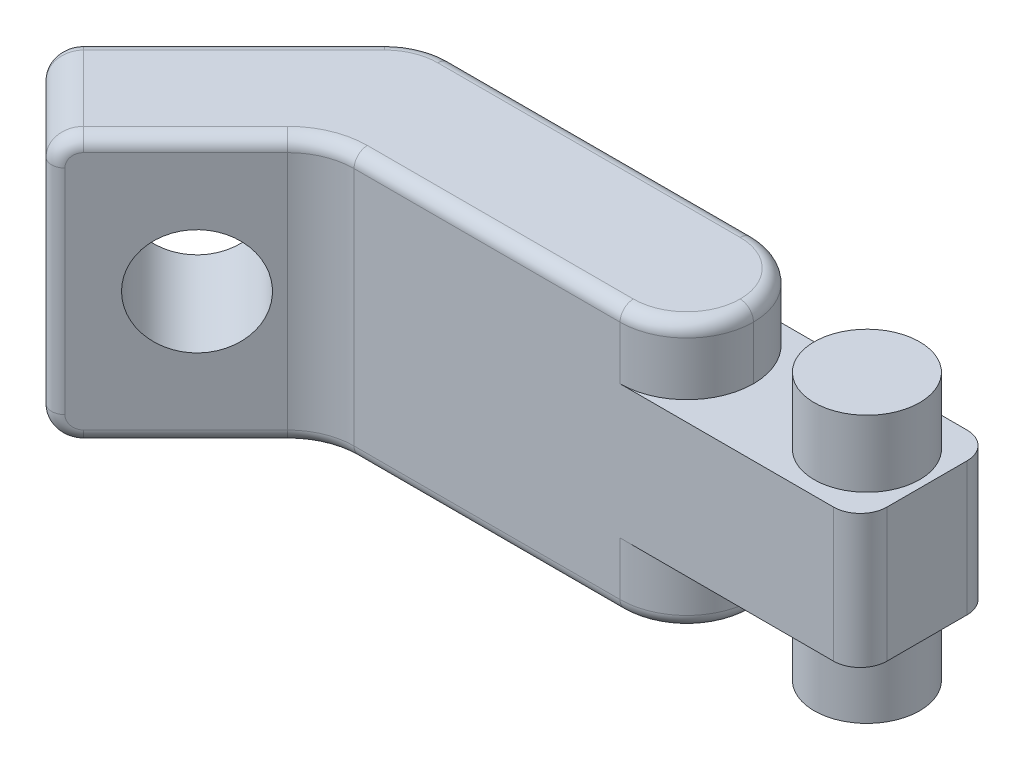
ISO-10303-21;
HEADER;
FILE_DESCRIPTION(('STEP AP214'),'2;1');
FILE_NAME('part.step','',(''),(''),'','','');
FILE_SCHEMA(('AUTOMOTIVE_DESIGN { 1 0 10303 214 1 1 1 1 }'));
ENDSEC;
DATA;
#1=APPLICATION_CONTEXT('core data for automotive mechanical design processes');
#2=APPLICATION_PROTOCOL_DEFINITION('international standard','automotive_design',2000,#1);
#3=PRODUCT_CONTEXT('',#1,'mechanical');
#4=PRODUCT('Part','Part','',(#3));
#5=PRODUCT_RELATED_PRODUCT_CATEGORY('part','',(#4));
#6=PRODUCT_DEFINITION_FORMATION('','',#4);
#7=PRODUCT_DEFINITION_CONTEXT('part definition',#1,'design');
#8=PRODUCT_DEFINITION('design','',#6,#7);
#9=PRODUCT_DEFINITION_SHAPE('','',#8);
#10=(LENGTH_UNIT() NAMED_UNIT(*) SI_UNIT(.MILLI.,.METRE.));
#11=(NAMED_UNIT(*) PLANE_ANGLE_UNIT() SI_UNIT($,.RADIAN.));
#12=(NAMED_UNIT(*) SI_UNIT($,.STERADIAN.) SOLID_ANGLE_UNIT());
#13=UNCERTAINTY_MEASURE_WITH_UNIT(LENGTH_MEASURE(1.E-05),#10,'distance_accuracy_value','');
#14=(GEOMETRIC_REPRESENTATION_CONTEXT(3) GLOBAL_UNCERTAINTY_ASSIGNED_CONTEXT((#13)) GLOBAL_UNIT_ASSIGNED_CONTEXT((#10,
#11,#12)) REPRESENTATION_CONTEXT('',''));
#15=CARTESIAN_POINT('',(0.,0.,0.));
#16=DIRECTION('',(0.,0.,1.));
#17=DIRECTION('',(1.,0.,0.));
#18=AXIS2_PLACEMENT_3D('',#15,#16,#17);
#19=CARTESIAN_POINT('',(505.060966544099,-188.971143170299,-16.0898233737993));
#20=DIRECTION('',(-1.,0.,0.));
#21=DIRECTION('',(0.,-1.,0.));
#22=AXIS2_PLACEMENT_3D('',#19,#20,#21);
#23=PLANE('',#22);
#24=DIRECTION('',(0.,0.,-1.));
#25=VECTOR('',#24,1.);
#26=CARTESIAN_POINT('',(505.060966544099,-38.9711431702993,-16.0898233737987));
#27=LINE('',#26,#25);
#28=CARTESIAN_POINT('',(505.060966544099,-38.9711431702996,63.9101766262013));
#29=VERTEX_POINT('',#28);
#30=CARTESIAN_POINT('',(505.060966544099,-38.9711431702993,3.91017662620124));
#31=VERTEX_POINT('',#30);
#32=EDGE_CURVE('E244',#29,#31,#27,.T.);
#33=ORIENTED_EDGE('',*,*,#32,.F.);
#34=DIRECTION('',(0.,1.,0.));
#35=VECTOR('',#34,1.);
#36=CARTESIAN_POINT('',(505.060966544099,-188.9711431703,63.9101766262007));
#37=LINE('',#36,#35);
#38=CARTESIAN_POINT('',(505.060966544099,-138.9711431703,63.9101766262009));
#39=VERTEX_POINT('',#38);
#40=EDGE_CURVE('E288',#29,#39,#37,.F.);
#41=ORIENTED_EDGE('',*,*,#40,.T.);
#42=DIRECTION('',(0.,0.,1.));
#43=VECTOR('',#42,1.);
#44=CARTESIAN_POINT('',(505.060966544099,-138.971143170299,-16.0898233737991));
#45=LINE('',#44,#43);
#46=CARTESIAN_POINT('',(505.060966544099,-138.971143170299,3.91017662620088));
#47=VERTEX_POINT('',#46);
#48=EDGE_CURVE('E458',#47,#39,#45,.T.);
#49=ORIENTED_EDGE('',*,*,#48,.F.);
#50=DIRECTION('',(0.,1.,0.));
#51=VECTOR('',#50,1.);
#52=CARTESIAN_POINT('',(505.060966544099,-188.971143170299,3.91017662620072));
#53=LINE('',#52,#51);
#54=EDGE_CURVE('E263',#47,#31,#53,.T.);
#55=ORIENTED_EDGE('',*,*,#54,.T.);
#56=EDGE_LOOP('',(#33,#41,#49,#55));
#57=FACE_BOUND('',#56,.T.);
#58=ADVANCED_FACE('F42',(#57),#23,.F.);
#59=CARTESIAN_POINT('',(77.7817459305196,-188.971143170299,-16.0898233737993));
#60=DIRECTION('',(0.,0.,1.));
#61=DIRECTION('',(0.,-1.,0.));
#62=AXIS2_PLACEMENT_3D('',#59,#60,#61);
#63=PLANE('',#62);
#64=DIRECTION('',(0.,1.,0.));
#65=VECTOR('',#64,1.);
#66=CARTESIAN_POINT('',(98.4924240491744,-188.971143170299,-16.0898233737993));
#67=LINE('',#66,#65);
#68=CARTESIAN_POINT('',(98.4924240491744,-178.971143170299,-16.0898233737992));
#69=VERTEX_POINT('',#68);
#70=CARTESIAN_POINT('',(98.4924240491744,1.02885682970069,-16.0898233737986));
#71=VERTEX_POINT('',#70);
#72=EDGE_CURVE('E486',#69,#71,#67,.T.);
#73=ORIENTED_EDGE('',*,*,#72,.T.);
#74=DIRECTION('',(1.,0.,0.));
#75=VECTOR('',#74,1.);
#76=CARTESIAN_POINT('',(77.7817459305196,1.02885682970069,-16.0898233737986));
#77=LINE('',#76,#75);
#78=CARTESIAN_POINT('',(325.060966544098,1.02885682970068,-16.0898233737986));
#79=VERTEX_POINT('',#78);
#80=EDGE_CURVE('E338',#71,#79,#77,.T.);
#81=ORIENTED_EDGE('',*,*,#80,.T.);
#82=DIRECTION('',(0.,-1.,0.));
#83=VECTOR('',#82,1.);
#84=CARTESIAN_POINT('',(325.060966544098,-38.9711431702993,-16.0898233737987));
#85=LINE('',#84,#83);
#86=CARTESIAN_POINT('',(325.060966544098,-38.9711431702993,-16.0898233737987));
#87=VERTEX_POINT('',#86);
#88=EDGE_CURVE('E258',#79,#87,#85,.T.);
#89=ORIENTED_EDGE('',*,*,#88,.T.);
#90=DIRECTION('',(-1.,0.,0.));
#91=VECTOR('',#90,1.);
#92=CARTESIAN_POINT('',(77.7817459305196,-38.9711431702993,-16.0898233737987));
#93=LINE('',#92,#91);
#94=CARTESIAN_POINT('',(485.060966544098,-38.9711431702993,-16.0898233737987));
#95=VERTEX_POINT('',#94);
#96=EDGE_CURVE('E241',#95,#87,#93,.T.);
#97=ORIENTED_EDGE('',*,*,#96,.F.);
#98=DIRECTION('',(0.,1.,0.));
#99=VECTOR('',#98,1.);
#100=CARTESIAN_POINT('',(485.060966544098,-188.971143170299,-16.0898233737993));
#101=LINE('',#100,#99);
#102=CARTESIAN_POINT('',(485.060966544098,-138.971143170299,-16.0898233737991));
#103=VERTEX_POINT('',#102);
#104=EDGE_CURVE('E255',#95,#103,#101,.F.);
#105=ORIENTED_EDGE('',*,*,#104,.T.);
#106=DIRECTION('',(1.,0.,0.));
#107=VECTOR('',#106,1.);
#108=CARTESIAN_POINT('',(77.7817459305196,-138.971143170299,-16.0898233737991));
#109=LINE('',#108,#107);
#110=CARTESIAN_POINT('',(325.060966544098,-138.971143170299,-16.0898233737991));
#111=VERTEX_POINT('',#110);
#112=EDGE_CURVE('E461',#111,#103,#109,.T.);
#113=ORIENTED_EDGE('',*,*,#112,.F.);
#114=DIRECTION('',(0.,-1.,0.));
#115=VECTOR('',#114,1.);
#116=CARTESIAN_POINT('',(325.060966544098,-188.971143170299,-16.0898233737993));
#117=LINE('',#116,#115);
#118=CARTESIAN_POINT('',(325.060966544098,-178.971143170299,-16.0898233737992));
#119=VERTEX_POINT('',#118);
#120=EDGE_CURVE('E502',#111,#119,#117,.T.);
#121=ORIENTED_EDGE('',*,*,#120,.T.);
#122=DIRECTION('',(1.,0.,0.));
#123=VECTOR('',#122,1.);
#124=CARTESIAN_POINT('',(98.4924240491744,-178.971143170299,-16.0898233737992));
#125=LINE('',#124,#123);
#126=EDGE_CURVE('E336',#119,#69,#125,.F.);
#127=ORIENTED_EDGE('',*,*,#126,.T.);
#128=EDGE_LOOP('',(#73,#81,#89,#97,#105,#113,#121,#127));
#129=FACE_BOUND('',#128,.T.);
#130=ADVANCED_FACE('F254',(#129),#63,.F.);
#131=CARTESIAN_POINT('',(505.060966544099,-188.9711431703,83.9101766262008));
#132=DIRECTION('',(0.,0.,-1.));
#133=DIRECTION('',(1.,0.,0.));
#134=AXIS2_PLACEMENT_3D('',#131,#132,#133);
#135=PLANE('',#134);
#136=DIRECTION('',(0.,-1.,0.));
#137=VECTOR('',#136,1.);
#138=CARTESIAN_POINT('',(325.060966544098,11.0288568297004,83.9101766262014));
#139=LINE('',#138,#137);
#140=CARTESIAN_POINT('',(325.060966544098,-38.9711431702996,83.9101766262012));
#141=VERTEX_POINT('',#140);
#142=CARTESIAN_POINT('',(325.060966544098,1.02885682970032,83.9101766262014));
#143=VERTEX_POINT('',#142);
#144=EDGE_CURVE('E274',#141,#143,#139,.F.);
#145=ORIENTED_EDGE('',*,*,#144,.T.);
#146=DIRECTION('',(-1.,0.,0.));
#147=VECTOR('',#146,1.);
#148=CARTESIAN_POINT('',(505.060966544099,1.02885682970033,83.9101766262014));
#149=LINE('',#148,#147);
#150=CARTESIAN_POINT('',(125.771644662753,1.02885682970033,83.9101766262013));
#151=VERTEX_POINT('',#150);
#152=EDGE_CURVE('E346',#143,#151,#149,.T.);
#153=ORIENTED_EDGE('',*,*,#152,.T.);
#154=DIRECTION('',(0.,1.,0.));
#155=VECTOR('',#154,1.);
#156=CARTESIAN_POINT('',(125.771644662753,-188.9711431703,83.9101766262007));
#157=LINE('',#156,#155);
#158=CARTESIAN_POINT('',(125.771644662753,-178.9711431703,83.9101766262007));
#159=VERTEX_POINT('',#158);
#160=EDGE_CURVE('E483',#151,#159,#157,.F.);
#161=ORIENTED_EDGE('',*,*,#160,.T.);
#162=DIRECTION('',(-1.,0.,0.));
#163=VECTOR('',#162,1.);
#164=CARTESIAN_POINT('',(325.060966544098,-178.9711431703,83.9101766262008));
#165=LINE('',#164,#163);
#166=CARTESIAN_POINT('',(325.060966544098,-178.9711431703,83.9101766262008));
#167=VERTEX_POINT('',#166);
#168=EDGE_CURVE('E344',#159,#167,#165,.F.);
#169=ORIENTED_EDGE('',*,*,#168,.T.);
#170=DIRECTION('',(0.,-1.,0.));
#171=VECTOR('',#170,1.);
#172=CARTESIAN_POINT('',(325.060966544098,-188.9711431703,83.9101766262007));
#173=LINE('',#172,#171);
#174=CARTESIAN_POINT('',(325.060966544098,-138.9711431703,83.9101766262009));
#175=VERTEX_POINT('',#174);
#176=EDGE_CURVE('E494',#167,#175,#173,.F.);
#177=ORIENTED_EDGE('',*,*,#176,.T.);
#178=DIRECTION('',(-1.,0.,0.));
#179=VECTOR('',#178,1.);
#180=CARTESIAN_POINT('',(505.060966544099,-138.9711431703,83.9101766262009));
#181=LINE('',#180,#179);
#182=CARTESIAN_POINT('',(485.060966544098,-138.9711431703,83.9101766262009));
#183=VERTEX_POINT('',#182);
#184=EDGE_CURVE('E491',#183,#175,#181,.T.);
#185=ORIENTED_EDGE('',*,*,#184,.F.);
#186=DIRECTION('',(0.,1.,0.));
#187=VECTOR('',#186,1.);
#188=CARTESIAN_POINT('',(485.060966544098,-188.9711431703,83.9101766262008));
#189=LINE('',#188,#187);
#190=CARTESIAN_POINT('',(485.060966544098,-38.9711431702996,83.9101766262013));
#191=VERTEX_POINT('',#190);
#192=EDGE_CURVE('E283',#183,#191,#189,.T.);
#193=ORIENTED_EDGE('',*,*,#192,.T.);
#194=DIRECTION('',(1.,0.,0.));
#195=VECTOR('',#194,1.);
#196=CARTESIAN_POINT('',(505.060966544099,-38.9711431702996,83.9101766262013));
#197=LINE('',#196,#195);
#198=EDGE_CURVE('E452',#141,#191,#197,.T.);
#199=ORIENTED_EDGE('',*,*,#198,.F.);
#200=EDGE_LOOP('',(#145,#153,#161,#169,#177,#185,#193,#199));
#201=FACE_BOUND('',#200,.T.);
#202=ADVANCED_FACE('F604',(#201),#135,.F.);
#203=CARTESIAN_POINT('',(485.060966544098,-188.971143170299,3.91017662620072));
#204=DIRECTION('',(0.,1.,0.));
#205=DIRECTION('',(-1.,0.,0.));
#206=AXIS2_PLACEMENT_3D('',#203,#204,#205);
#207=CYLINDRICAL_SURFACE('',#206,20.);
#208=ORIENTED_EDGE('',*,*,#104,.F.);
#209=CARTESIAN_POINT('',(485.060966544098,-38.9711431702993,3.91017662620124));
#210=DIRECTION('',(0.,1.,0.));
#211=DIRECTION('',(-1.,0.,0.));
#212=AXIS2_PLACEMENT_3D('',#209,#210,#211);
#213=CIRCLE('',#212,20.);
#214=EDGE_CURVE('E236',#95,#31,#213,.F.);
#215=ORIENTED_EDGE('',*,*,#214,.T.);
#216=ORIENTED_EDGE('',*,*,#54,.F.);
#217=CARTESIAN_POINT('',(485.060966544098,-138.971143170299,3.91017662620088));
#218=DIRECTION('',(0.,-1.,0.));
#219=DIRECTION('',(1.,0.,0.));
#220=AXIS2_PLACEMENT_3D('',#217,#218,#219);
#221=CIRCLE('',#220,20.);
#222=EDGE_CURVE('E250',#103,#47,#221,.T.);
#223=ORIENTED_EDGE('',*,*,#222,.F.);
#224=EDGE_LOOP('',(#208,#215,#216,#223));
#225=FACE_BOUND('',#224,.T.);
#226=ADVANCED_FACE('F262',(#225),#207,.T.);
#227=CARTESIAN_POINT('',(105.060966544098,-188.9711431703,83.9101766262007));
#228=DIRECTION('',(-0.707106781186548,0.,-0.707106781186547));
#229=DIRECTION('',(0.707106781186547,0.,-0.707106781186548));
#230=AXIS2_PLACEMENT_3D('',#227,#228,#229);
#231=PLANE('',#230);
#232=CARTESIAN_POINT('',(56.5685424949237,-88.9711431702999,132.402600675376));
#233=DIRECTION('',(0.707106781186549,0.,0.707106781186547));
#234=DIRECTION('',(-0.707106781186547,0.,0.707106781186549));
#235=AXIS2_PLACEMENT_3D('',#232,#233,#234);
#236=CIRCLE('',#235,40.);
#237=CARTESIAN_POINT('',(28.2842712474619,-88.9711431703,160.686871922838));
#238=VERTEX_POINT('',#237);
#239=EDGE_CURVE('E463',#238,#238,#236,.T.);
#240=ORIENTED_EDGE('',*,*,#239,.F.);
#241=EDGE_LOOP('',(#240));
#242=FACE_BOUND('',#241,.T.);
#243=DIRECTION('',(0.,1.,0.));
#244=VECTOR('',#243,1.);
#245=CARTESIAN_POINT('',(90.4163056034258,11.0288568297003,98.5548375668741));
#246=LINE('',#245,#244);
#247=CARTESIAN_POINT('',(90.4163056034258,-178.9711431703,98.5548375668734));
#248=VERTEX_POINT('',#247);
#249=CARTESIAN_POINT('',(90.4163056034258,1.02885682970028,98.554837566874));
#250=VERTEX_POINT('',#249);
#251=EDGE_CURVE('E480',#248,#250,#246,.T.);
#252=ORIENTED_EDGE('',*,*,#251,.T.);
#253=DIRECTION('',(-0.707106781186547,0.,0.707106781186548));
#254=VECTOR('',#253,1.);
#255=CARTESIAN_POINT('',(105.060966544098,1.02885682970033,83.9101766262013));
#256=LINE('',#255,#254);
#257=CARTESIAN_POINT('',(14.1421356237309,1.02885682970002,174.829007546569));
#258=VERTEX_POINT('',#257);
#259=EDGE_CURVE('E360',#250,#258,#256,.T.);
#260=ORIENTED_EDGE('',*,*,#259,.T.);
#261=CARTESIAN_POINT('',(14.1421356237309,-8.97114317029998,174.829007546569));
#262=DIRECTION('',(-0.707106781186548,0.,-0.707106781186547));
#263=DIRECTION('',(-0.707106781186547,0.,0.707106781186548));
#264=AXIS2_PLACEMENT_3D('',#261,#262,#263);
#265=CIRCLE('',#264,10.);
#266=CARTESIAN_POINT('',(7.07106781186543,-8.9711431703,181.900075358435));
#267=VERTEX_POINT('',#266);
#268=EDGE_CURVE('E358',#258,#267,#265,.F.);
#269=ORIENTED_EDGE('',*,*,#268,.T.);
#270=DIRECTION('',(0.,1.,0.));
#271=VECTOR('',#270,1.);
#272=CARTESIAN_POINT('',(7.07106781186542,-188.9711431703,181.900075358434));
#273=LINE('',#272,#271);
#274=CARTESIAN_POINT('',(7.07106781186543,-168.9711431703,181.900075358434));
#275=VERTEX_POINT('',#274);
#276=EDGE_CURVE('E356',#267,#275,#273,.F.);
#277=ORIENTED_EDGE('',*,*,#276,.T.);
#278=CARTESIAN_POINT('',(14.1421356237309,-168.9711431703,174.829007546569));
#279=DIRECTION('',(-0.707106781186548,0.,-0.707106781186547));
#280=DIRECTION('',(-0.707106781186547,0.,0.707106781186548));
#281=AXIS2_PLACEMENT_3D('',#278,#279,#280);
#282=CIRCLE('',#281,10.);
#283=CARTESIAN_POINT('',(14.1421356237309,-178.9711431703,174.829007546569));
#284=VERTEX_POINT('',#283);
#285=EDGE_CURVE('E354',#275,#284,#282,.F.);
#286=ORIENTED_EDGE('',*,*,#285,.T.);
#287=DIRECTION('',(-0.707106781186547,0.,0.707106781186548));
#288=VECTOR('',#287,1.);
#289=CARTESIAN_POINT('',(90.4163056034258,-178.9711431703,98.5548375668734));
#290=LINE('',#289,#288);
#291=EDGE_CURVE('E352',#284,#248,#290,.F.);
#292=ORIENTED_EDGE('',*,*,#291,.T.);
#293=EDGE_LOOP('',(#252,#260,#269,#277,#286,#292));
#294=FACE_BOUND('',#293,.T.);
#295=ADVANCED_FACE('F564',(#242,#294),#231,.F.);
#296=CARTESIAN_POINT('',(0.,-188.9711431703,188.971143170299));
#297=DIRECTION('',(0.707106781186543,0.,-0.707106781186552));
#298=DIRECTION('',(0.707106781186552,0.,0.707106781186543));
#299=AXIS2_PLACEMENT_3D('',#296,#297,#298);
#300=PLANE('',#299);
#301=DIRECTION('',(-0.707106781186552,0.,-0.707106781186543));
#302=VECTOR('',#301,1.);
#303=CARTESIAN_POINT('',(0.,-8.97114317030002,188.9711431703));
#304=LINE('',#303,#302);
#305=CARTESIAN_POINT('',(-7.07106781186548,-8.9711431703,181.900075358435));
#306=VERTEX_POINT('',#305);
#307=CARTESIAN_POINT('',(-56.5685424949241,-8.97114317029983,132.402600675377));
#308=VERTEX_POINT('',#307);
#309=EDGE_CURVE('E474',#306,#308,#304,.T.);
#310=ORIENTED_EDGE('',*,*,#309,.T.);
#311=DIRECTION('',(0.,1.,0.));
#312=VECTOR('',#311,1.);
#313=CARTESIAN_POINT('',(-56.5685424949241,-188.9711431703,132.402600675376));
#314=LINE('',#313,#312);
#315=CARTESIAN_POINT('',(-56.5685424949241,-168.9711431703,132.402600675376));
#316=VERTEX_POINT('',#315);
#317=EDGE_CURVE('E310',#308,#316,#314,.F.);
#318=ORIENTED_EDGE('',*,*,#317,.T.);
#319=DIRECTION('',(-0.707106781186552,0.,-0.707106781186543));
#320=VECTOR('',#319,1.);
#321=CARTESIAN_POINT('',(0.,-168.9711431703,188.971143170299));
#322=LINE('',#321,#320);
#323=CARTESIAN_POINT('',(-7.07106781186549,-168.9711431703,181.900075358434));
#324=VERTEX_POINT('',#323);
#325=EDGE_CURVE('E471',#316,#324,#322,.F.);
#326=ORIENTED_EDGE('',*,*,#325,.T.);
#327=DIRECTION('',(0.,1.,0.));
#328=VECTOR('',#327,1.);
#329=CARTESIAN_POINT('',(-7.07106781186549,-188.9711431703,181.900075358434));
#330=LINE('',#329,#328);
#331=EDGE_CURVE('E308',#324,#306,#330,.T.);
#332=ORIENTED_EDGE('',*,*,#331,.T.);
#333=EDGE_LOOP('',(#310,#318,#326,#332));
#334=FACE_BOUND('',#333,.T.);
#335=ADVANCED_FACE('F553',(#334),#300,.F.);
#336=CARTESIAN_POINT('',(-63.6396103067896,-188.9711431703,125.331532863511));
#337=DIRECTION('',(0.707106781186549,0.,0.707106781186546));
#338=DIRECTION('',(-0.707106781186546,0.,0.707106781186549));
#339=AXIS2_PLACEMENT_3D('',#336,#337,#338);
#340=PLANE('',#339);
#341=CARTESIAN_POINT('',(-7.07106781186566,-88.9711431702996,68.7629903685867));
#342=DIRECTION('',(0.707106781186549,0.,0.707106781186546));
#343=DIRECTION('',(-0.707106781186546,0.,0.707106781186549));
#344=AXIS2_PLACEMENT_3D('',#341,#342,#343);
#345=CIRCLE('',#344,40.);
#346=CARTESIAN_POINT('',(-35.3553390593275,-88.9711431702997,97.0472616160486));
#347=VERTEX_POINT('',#346);
#348=EDGE_CURVE('E466',#347,#347,#345,.T.);
#349=ORIENTED_EDGE('',*,*,#348,.T.);
#350=EDGE_LOOP('',(#349));
#351=FACE_BOUND('',#350,.T.);
#352=CARTESIAN_POINT('',(-49.4974746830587,-8.97114317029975,111.18939723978));
#353=DIRECTION('',(0.707106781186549,0.,0.707106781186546));
#354=DIRECTION('',(0.707106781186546,0.,-0.707106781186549));
#355=AXIS2_PLACEMENT_3D('',#352,#353,#354);
#356=CIRCLE('',#355,10.);
#357=CARTESIAN_POINT('',(-56.5685424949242,-8.97114317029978,118.260465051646));
#358=VERTEX_POINT('',#357);
#359=CARTESIAN_POINT('',(-49.4974746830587,1.02885682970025,111.18939723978));
#360=VERTEX_POINT('',#359);
#361=EDGE_CURVE('E299',#358,#360,#356,.F.);
#362=ORIENTED_EDGE('',*,*,#361,.T.);
#363=DIRECTION('',(0.707106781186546,0.,-0.707106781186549));
#364=VECTOR('',#363,1.);
#365=CARTESIAN_POINT('',(-63.6396103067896,1.02885682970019,125.331532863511));
#366=LINE('',#365,#364);
#367=CARTESIAN_POINT('',(63.1370849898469,1.02885682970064,-1.4451624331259));
#368=VERTEX_POINT('',#367);
#369=EDGE_CURVE('E301',#360,#368,#366,.T.);
#370=ORIENTED_EDGE('',*,*,#369,.T.);
#371=DIRECTION('',(0.,1.,0.));
#372=VECTOR('',#371,1.);
#373=CARTESIAN_POINT('',(63.1370849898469,-188.971143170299,-1.44516243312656));
#374=LINE('',#373,#372);
#375=CARTESIAN_POINT('',(63.1370849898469,-178.971143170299,-1.44516243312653));
#376=VERTEX_POINT('',#375);
#377=EDGE_CURVE('E488',#368,#376,#374,.F.);
#378=ORIENTED_EDGE('',*,*,#377,.T.);
#379=DIRECTION('',(0.707106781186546,0.,-0.707106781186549));
#380=VECTOR('',#379,1.);
#381=CARTESIAN_POINT('',(-49.4974746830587,-178.9711431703,111.18939723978));
#382=LINE('',#381,#380);
#383=CARTESIAN_POINT('',(-49.4974746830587,-178.9711431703,111.18939723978));
#384=VERTEX_POINT('',#383);
#385=EDGE_CURVE('E292',#376,#384,#382,.F.);
#386=ORIENTED_EDGE('',*,*,#385,.T.);
#387=CARTESIAN_POINT('',(-49.4974746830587,-168.9711431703,111.18939723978));
#388=DIRECTION('',(0.707106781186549,0.,0.707106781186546));
#389=DIRECTION('',(0.707106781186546,0.,-0.707106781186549));
#390=AXIS2_PLACEMENT_3D('',#387,#388,#389);
#391=CIRCLE('',#390,10.);
#392=CARTESIAN_POINT('',(-56.5685424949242,-168.9711431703,118.260465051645));
#393=VERTEX_POINT('',#392);
#394=EDGE_CURVE('E294',#384,#393,#391,.F.);
#395=ORIENTED_EDGE('',*,*,#394,.T.);
#396=DIRECTION('',(0.,1.,0.));
#397=VECTOR('',#396,1.);
#398=CARTESIAN_POINT('',(-56.5685424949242,-188.9711431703,118.260465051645));
#399=LINE('',#398,#397);
#400=EDGE_CURVE('E297',#393,#358,#399,.T.);
#401=ORIENTED_EDGE('',*,*,#400,.T.);
#402=EDGE_LOOP('',(#362,#370,#378,#386,#395,#401));
#403=FACE_BOUND('',#402,.T.);
#404=ADVANCED_FACE('F533',(#351,#403),#340,.F.);
#405=CARTESIAN_POINT('',(0.,-188.9711431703,188.971143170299));
#406=DIRECTION('',(0.,-1.,0.));
#407=DIRECTION('',(1.,0.,0.));
#408=AXIS2_PLACEMENT_3D('',#405,#406,#407);
#409=PLANE('',#408);
#410=DIRECTION('',(-0.707106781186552,0.,-0.707106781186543));
#411=VECTOR('',#410,1.);
#412=CARTESIAN_POINT('',(-49.4974746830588,-188.9711431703,111.189397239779));
#413=LINE('',#412,#411);
#414=CARTESIAN_POINT('',(7.07106781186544,-188.9711431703,167.757939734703));
#415=VERTEX_POINT('',#414);
#416=CARTESIAN_POINT('',(-42.4264068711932,-188.9711431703,118.260465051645));
#417=VERTEX_POINT('',#416);
#418=EDGE_CURVE('E469',#415,#417,#413,.T.);
#419=ORIENTED_EDGE('',*,*,#418,.T.);
#420=DIRECTION('',(0.707106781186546,0.,-0.707106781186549));
#421=VECTOR('',#420,1.);
#422=CARTESIAN_POINT('',(70.2081528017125,-188.971143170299,5.62590537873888));
#423=LINE('',#422,#421);
#424=CARTESIAN_POINT('',(70.2081528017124,-188.971143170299,5.62590537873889));
#425=VERTEX_POINT('',#424);
#426=EDGE_CURVE('E66',#417,#425,#423,.T.);
#427=ORIENTED_EDGE('',*,*,#426,.T.);
#428=CARTESIAN_POINT('',(98.4924240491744,-188.9711431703,33.9101766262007));
#429=DIRECTION('',(0.,-1.,0.));
#430=DIRECTION('',(0.,0.,-1.));
#431=AXIS2_PLACEMENT_3D('',#428,#429,#430);
#432=CIRCLE('',#431,40.);
#433=CARTESIAN_POINT('',(98.4924240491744,-188.971143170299,-6.08982337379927));
#434=VERTEX_POINT('',#433);
#435=EDGE_CURVE('E374',#425,#434,#432,.T.);
#436=ORIENTED_EDGE('',*,*,#435,.T.);
#437=DIRECTION('',(1.,0.,0.));
#438=VECTOR('',#437,1.);
#439=CARTESIAN_POINT('',(325.060966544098,-188.971143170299,-6.08982337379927));
#440=LINE('',#439,#438);
#441=CARTESIAN_POINT('',(325.060966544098,-188.971143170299,-6.08982337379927));
#442=VERTEX_POINT('',#441);
#443=EDGE_CURVE('E362',#434,#442,#440,.T.);
#444=ORIENTED_EDGE('',*,*,#443,.T.);
#445=CARTESIAN_POINT('',(325.060966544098,-188.9711431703,33.9101766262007));
#446=DIRECTION('',(0.,-1.,0.));
#447=DIRECTION('',(0.,0.,-1.));
#448=AXIS2_PLACEMENT_3D('',#445,#446,#447);
#449=CIRCLE('',#448,40.);
#450=CARTESIAN_POINT('',(365.060966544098,-188.9711431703,33.9101766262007));
#451=VERTEX_POINT('',#450);
#452=EDGE_CURVE('E364',#442,#451,#449,.T.);
#453=ORIENTED_EDGE('',*,*,#452,.T.);
#454=CARTESIAN_POINT('',(325.060966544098,-188.9711431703,33.9101766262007));
#455=DIRECTION('',(0.,-1.,0.));
#456=DIRECTION('',(0.,0.,-1.));
#457=AXIS2_PLACEMENT_3D('',#454,#455,#456);
#458=CIRCLE('',#457,40.);
#459=CARTESIAN_POINT('',(325.060966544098,-188.9711431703,73.9101766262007));
#460=VERTEX_POINT('',#459);
#461=EDGE_CURVE('E366',#451,#460,#458,.T.);
#462=ORIENTED_EDGE('',*,*,#461,.T.);
#463=DIRECTION('',(-1.,0.,0.));
#464=VECTOR('',#463,1.);
#465=CARTESIAN_POINT('',(125.771644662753,-188.9711431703,73.9101766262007));
#466=LINE('',#465,#464);
#467=CARTESIAN_POINT('',(125.771644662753,-188.9711431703,73.9101766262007));
#468=VERTEX_POINT('',#467);
#469=EDGE_CURVE('E368',#460,#468,#466,.T.);
#470=ORIENTED_EDGE('',*,*,#469,.T.);
#471=CARTESIAN_POINT('',(125.771644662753,-188.9711431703,133.910176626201));
#472=DIRECTION('',(0.,-1.,0.));
#473=DIRECTION('',(0.,0.,-1.));
#474=AXIS2_PLACEMENT_3D('',#471,#472,#473);
#475=CIRCLE('',#474,60.);
#476=CARTESIAN_POINT('',(83.3452377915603,-188.9711431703,91.4837697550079));
#477=VERTEX_POINT('',#476);
#478=EDGE_CURVE('E370',#468,#477,#475,.F.);
#479=ORIENTED_EDGE('',*,*,#478,.T.);
#480=DIRECTION('',(-0.707106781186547,0.,0.707106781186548));
#481=VECTOR('',#480,1.);
#482=CARTESIAN_POINT('',(7.07106781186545,-188.9711431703,167.757939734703));
#483=LINE('',#482,#481);
#484=EDGE_CURVE('E372',#477,#415,#483,.T.);
#485=ORIENTED_EDGE('',*,*,#484,.T.);
#486=EDGE_LOOP('',(#419,#427,#436,#444,#453,#462,#470,#479,#485));
#487=FACE_BOUND('',#486,.T.);
#488=ADVANCED_FACE('F635',(#487),#409,.T.);
#489=CARTESIAN_POINT('',(0.,11.0288568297,188.9711431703));
#490=DIRECTION('',(0.,-1.,0.));
#491=DIRECTION('',(1.,0.,0.));
#492=AXIS2_PLACEMENT_3D('',#489,#490,#491);
#493=PLANE('',#492);
#494=CARTESIAN_POINT('',(98.4924240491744,11.0288568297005,33.9101766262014));
#495=DIRECTION('',(0.,-1.,0.));
#496=DIRECTION('',(0.,0.,-1.));
#497=AXIS2_PLACEMENT_3D('',#494,#495,#496);
#498=CIRCLE('',#497,40.);
#499=CARTESIAN_POINT('',(98.4924240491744,11.0288568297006,-6.08982337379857));
#500=VERTEX_POINT('',#499);
#501=CARTESIAN_POINT('',(70.2081528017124,11.0288568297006,5.62590537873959));
#502=VERTEX_POINT('',#501);
#503=EDGE_CURVE('E328',#500,#502,#498,.F.);
#504=ORIENTED_EDGE('',*,*,#503,.T.);
#505=DIRECTION('',(0.707106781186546,0.,-0.707106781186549));
#506=VECTOR('',#505,1.);
#507=CARTESIAN_POINT('',(-56.5685424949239,11.0288568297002,132.402600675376));
#508=LINE('',#507,#506);
#509=CARTESIAN_POINT('',(-42.4264068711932,11.0288568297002,118.260465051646));
#510=VERTEX_POINT('',#509);
#511=EDGE_CURVE('E330',#502,#510,#508,.F.);
#512=ORIENTED_EDGE('',*,*,#511,.T.);
#513=DIRECTION('',(-0.707106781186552,0.,-0.707106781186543));
#514=VECTOR('',#513,1.);
#515=CARTESIAN_POINT('',(14.1421356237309,11.0288568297,174.829007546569));
#516=LINE('',#515,#514);
#517=CARTESIAN_POINT('',(7.07106781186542,11.0288568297,167.757939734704));
#518=VERTEX_POINT('',#517);
#519=EDGE_CURVE('E477',#510,#518,#516,.F.);
#520=ORIENTED_EDGE('',*,*,#519,.T.);
#521=DIRECTION('',(-0.707106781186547,0.,0.707106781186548));
#522=VECTOR('',#521,1.);
#523=CARTESIAN_POINT('',(-7.07106781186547,11.0288568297,181.900075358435));
#524=LINE('',#523,#522);
#525=CARTESIAN_POINT('',(83.3452377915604,11.0288568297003,91.4837697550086));
#526=VERTEX_POINT('',#525);
#527=EDGE_CURVE('E316',#518,#526,#524,.F.);
#528=ORIENTED_EDGE('',*,*,#527,.T.);
#529=CARTESIAN_POINT('',(125.771644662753,11.0288568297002,133.910176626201));
#530=DIRECTION('',(0.,-1.,0.));
#531=DIRECTION('',(0.,0.,-1.));
#532=AXIS2_PLACEMENT_3D('',#529,#530,#531);
#533=CIRCLE('',#532,60.);
#534=CARTESIAN_POINT('',(125.771644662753,11.0288568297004,73.9101766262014));
#535=VERTEX_POINT('',#534);
#536=EDGE_CURVE('E318',#526,#535,#533,.T.);
#537=ORIENTED_EDGE('',*,*,#536,.T.);
#538=DIRECTION('',(-1.,0.,0.));
#539=VECTOR('',#538,1.);
#540=CARTESIAN_POINT('',(0.,11.0288568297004,73.9101766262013));
#541=LINE('',#540,#539);
#542=CARTESIAN_POINT('',(325.060966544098,11.0288568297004,73.9101766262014));
#543=VERTEX_POINT('',#542);
#544=EDGE_CURVE('E320',#535,#543,#541,.F.);
#545=ORIENTED_EDGE('',*,*,#544,.T.);
#546=CARTESIAN_POINT('',(325.060966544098,11.0288568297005,33.9101766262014));
#547=DIRECTION('',(0.,-1.,0.));
#548=DIRECTION('',(0.,0.,-1.));
#549=AXIS2_PLACEMENT_3D('',#546,#547,#548);
#550=CIRCLE('',#549,40.);
#551=CARTESIAN_POINT('',(365.060966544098,11.0288568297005,33.9101766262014));
#552=VERTEX_POINT('',#551);
#553=EDGE_CURVE('E322',#543,#552,#550,.F.);
#554=ORIENTED_EDGE('',*,*,#553,.T.);
#555=CARTESIAN_POINT('',(325.060966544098,11.0288568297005,33.9101766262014));
#556=DIRECTION('',(0.,-1.,0.));
#557=DIRECTION('',(0.,0.,-1.));
#558=AXIS2_PLACEMENT_3D('',#555,#556,#557);
#559=CIRCLE('',#558,40.);
#560=CARTESIAN_POINT('',(325.060966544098,11.0288568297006,-6.08982337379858));
#561=VERTEX_POINT('',#560);
#562=EDGE_CURVE('E324',#552,#561,#559,.F.);
#563=ORIENTED_EDGE('',*,*,#562,.T.);
#564=DIRECTION('',(1.,0.,0.));
#565=VECTOR('',#564,1.);
#566=CARTESIAN_POINT('',(0.,11.0288568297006,-6.08982337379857));
#567=LINE('',#566,#565);
#568=EDGE_CURVE('E326',#561,#500,#567,.F.);
#569=ORIENTED_EDGE('',*,*,#568,.T.);
#570=EDGE_LOOP('',(#504,#512,#520,#528,#537,#545,#554,#563,#569));
#571=FACE_BOUND('',#570,.T.);
#572=ADVANCED_FACE('F569',(#571),#493,.F.);
#573=CARTESIAN_POINT('',(-77.7817459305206,-88.9711431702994,-1.94768775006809));
#574=DIRECTION('',(0.707106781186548,0.,0.707106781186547));
#575=DIRECTION('',(-0.707106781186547,0.,0.707106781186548));
#576=AXIS2_PLACEMENT_3D('',#573,#574,#575);
#577=CYLINDRICAL_SURFACE('',#576,40.);
#578=ORIENTED_EDGE('',*,*,#239,.T.);
#579=EDGE_LOOP('',(#578));
#580=FACE_BOUND('',#579,.T.);
#581=ORIENTED_EDGE('',*,*,#348,.F.);
#582=EDGE_LOOP('',(#581));
#583=FACE_BOUND('',#582,.T.);
#584=ADVANCED_FACE('F645',(#580,#583),#577,.F.);
#585=CARTESIAN_POINT('',(14.1421356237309,-168.9711431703,174.829007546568));
#586=DIRECTION('',(0.707106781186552,0.,0.707106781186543));
#587=DIRECTION('',(-0.707106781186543,0.,0.707106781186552));
#588=AXIS2_PLACEMENT_3D('',#585,#586,#587);
#589=CYLINDRICAL_SURFACE('',#588,20.);
#590=ORIENTED_EDGE('',*,*,#325,.F.);
#591=CARTESIAN_POINT('',(-42.4264068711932,-168.9711431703,118.260465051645));
#592=DIRECTION('',(0.707106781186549,0.,0.707106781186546));
#593=DIRECTION('',(0.707106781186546,0.,-0.707106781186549));
#594=AXIS2_PLACEMENT_3D('',#591,#592,#593);
#595=CIRCLE('',#594,20.);
#596=EDGE_CURVE('E305',#316,#417,#595,.T.);
#597=ORIENTED_EDGE('',*,*,#596,.T.);
#598=ORIENTED_EDGE('',*,*,#418,.F.);
#599=CARTESIAN_POINT('',(7.07106781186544,-168.9711431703,167.757939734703));
#600=DIRECTION('',(-0.707106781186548,0.,-0.707106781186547));
#601=DIRECTION('',(-0.707106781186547,0.,0.707106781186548));
#602=AXIS2_PLACEMENT_3D('',#599,#600,#601);
#603=CIRCLE('',#602,20.);
#604=EDGE_CURVE('E303',#415,#324,#603,.T.);
#605=ORIENTED_EDGE('',*,*,#604,.T.);
#606=EDGE_LOOP('',(#590,#597,#598,#605));
#607=FACE_BOUND('',#606,.T.);
#608=ADVANCED_FACE('F642',(#607),#589,.T.);
#609=CARTESIAN_POINT('',(14.1421356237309,-8.97114317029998,174.829007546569));
#610=DIRECTION('',(-0.707106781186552,0.,-0.707106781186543));
#611=DIRECTION('',(0.707106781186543,0.,-0.707106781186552));
#612=AXIS2_PLACEMENT_3D('',#609,#610,#611);
#613=CYLINDRICAL_SURFACE('',#612,20.);
#614=ORIENTED_EDGE('',*,*,#519,.F.);
#615=CARTESIAN_POINT('',(-42.4264068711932,-8.97114317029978,118.260465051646));
#616=DIRECTION('',(0.707106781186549,0.,0.707106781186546));
#617=DIRECTION('',(0.707106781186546,0.,-0.707106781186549));
#618=AXIS2_PLACEMENT_3D('',#615,#616,#617);
#619=CIRCLE('',#618,20.);
#620=EDGE_CURVE('E314',#510,#308,#619,.T.);
#621=ORIENTED_EDGE('',*,*,#620,.T.);
#622=ORIENTED_EDGE('',*,*,#309,.F.);
#623=CARTESIAN_POINT('',(7.07106781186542,-8.97114317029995,167.757939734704));
#624=DIRECTION('',(-0.707106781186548,0.,-0.707106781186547));
#625=DIRECTION('',(-0.707106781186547,0.,0.707106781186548));
#626=AXIS2_PLACEMENT_3D('',#623,#624,#625);
#627=CIRCLE('',#626,20.);
#628=EDGE_CURVE('E312',#306,#518,#627,.T.);
#629=ORIENTED_EDGE('',*,*,#628,.T.);
#630=EDGE_LOOP('',(#614,#621,#622,#629));
#631=FACE_BOUND('',#630,.T.);
#632=ADVANCED_FACE('F550',(#631),#613,.T.);
#633=CARTESIAN_POINT('',(125.771644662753,-188.9711431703,133.910176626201));
#634=DIRECTION('',(0.,-1.,0.));
#635=DIRECTION('',(1.,0.,0.));
#636=AXIS2_PLACEMENT_3D('',#633,#634,#635);
#637=CYLINDRICAL_SURFACE('',#636,50.);
#638=ORIENTED_EDGE('',*,*,#160,.F.);
#639=CARTESIAN_POINT('',(125.771644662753,1.02885682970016,133.910176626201));
#640=DIRECTION('',(0.,-1.,0.));
#641=DIRECTION('',(0.,0.,-1.));
#642=AXIS2_PLACEMENT_3D('',#639,#640,#641);
#643=CIRCLE('',#642,50.);
#644=EDGE_CURVE('E350',#151,#250,#643,.F.);
#645=ORIENTED_EDGE('',*,*,#644,.T.);
#646=ORIENTED_EDGE('',*,*,#251,.F.);
#647=CARTESIAN_POINT('',(125.771644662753,-178.9711431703,133.910176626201));
#648=DIRECTION('',(0.,-1.,0.));
#649=DIRECTION('',(0.,0.,-1.));
#650=AXIS2_PLACEMENT_3D('',#647,#648,#649);
#651=CIRCLE('',#650,50.);
#652=EDGE_CURVE('E348',#248,#159,#651,.T.);
#653=ORIENTED_EDGE('',*,*,#652,.T.);
#654=EDGE_LOOP('',(#638,#645,#646,#653));
#655=FACE_BOUND('',#654,.T.);
#656=ADVANCED_FACE('F608',(#655),#637,.F.);
#657=CARTESIAN_POINT('',(98.4924240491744,-188.9711431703,33.9101766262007));
#658=DIRECTION('',(0.,1.,0.));
#659=DIRECTION('',(-1.,0.,0.));
#660=AXIS2_PLACEMENT_3D('',#657,#658,#659);
#661=CYLINDRICAL_SURFACE('',#660,50.);
#662=ORIENTED_EDGE('',*,*,#377,.F.);
#663=CARTESIAN_POINT('',(98.4924240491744,1.02885682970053,33.9101766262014));
#664=DIRECTION('',(0.,-1.,0.));
#665=DIRECTION('',(0.,0.,-1.));
#666=AXIS2_PLACEMENT_3D('',#663,#664,#665);
#667=CIRCLE('',#666,50.);
#668=EDGE_CURVE('E334',#368,#71,#667,.T.);
#669=ORIENTED_EDGE('',*,*,#668,.T.);
#670=ORIENTED_EDGE('',*,*,#72,.F.);
#671=CARTESIAN_POINT('',(98.4924240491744,-178.971143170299,33.9101766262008));
#672=DIRECTION('',(0.,-1.,0.));
#673=DIRECTION('',(0.,0.,-1.));
#674=AXIS2_PLACEMENT_3D('',#671,#672,#673);
#675=CIRCLE('',#674,50.);
#676=EDGE_CURVE('E332',#69,#376,#675,.F.);
#677=ORIENTED_EDGE('',*,*,#676,.T.);
#678=EDGE_LOOP('',(#662,#669,#670,#677));
#679=FACE_BOUND('',#678,.T.);
#680=ADVANCED_FACE('F530',(#679),#661,.T.);
#681=CARTESIAN_POINT('',(450.060966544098,-138.9711431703,33.9101766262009));
#682=DIRECTION('',(0.,-1.,0.));
#683=DIRECTION('',(1.,0.,0.));
#684=AXIS2_PLACEMENT_3D('',#681,#682,#683);
#685=PLANE('',#684);
#686=CARTESIAN_POINT('',(460.060966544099,-138.9711431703,33.9101766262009));
#687=DIRECTION('',(0.,-1.,0.));
#688=DIRECTION('',(1.,0.,0.));
#689=AXIS2_PLACEMENT_3D('',#686,#687,#688);
#690=CIRCLE('',#689,39.5000000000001);
#691=CARTESIAN_POINT('',(499.560966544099,-138.9711431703,33.9101766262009));
#692=VERTEX_POINT('',#691);
#693=EDGE_CURVE('E457',#692,#692,#690,.F.);
#694=ORIENTED_EDGE('',*,*,#693,.T.);
#695=EDGE_LOOP('',(#694));
#696=FACE_BOUND('',#695,.T.);
#697=ORIENTED_EDGE('',*,*,#48,.T.);
#698=CARTESIAN_POINT('',(485.060966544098,-138.9711431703,63.9101766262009));
#699=DIRECTION('',(0.,-1.,0.));
#700=DIRECTION('',(0.,0.,-1.));
#701=AXIS2_PLACEMENT_3D('',#698,#699,#700);
#702=CIRCLE('',#701,20.);
#703=EDGE_CURVE('E290',#39,#183,#702,.T.);
#704=ORIENTED_EDGE('',*,*,#703,.T.);
#705=ORIENTED_EDGE('',*,*,#184,.T.);
#706=CARTESIAN_POINT('',(325.060966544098,-138.9711431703,33.9101766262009));
#707=DIRECTION('',(0.,-1.,0.));
#708=DIRECTION('',(1.,0.,0.));
#709=AXIS2_PLACEMENT_3D('',#706,#707,#708);
#710=CIRCLE('',#709,50.);
#711=CARTESIAN_POINT('',(375.060966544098,-138.9711431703,33.9101766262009));
#712=VERTEX_POINT('',#711);
#713=EDGE_CURVE('E500',#175,#712,#710,.F.);
#714=ORIENTED_EDGE('',*,*,#713,.T.);
#715=CARTESIAN_POINT('',(325.060966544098,-138.9711431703,33.9101766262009));
#716=DIRECTION('',(0.,-1.,0.));
#717=DIRECTION('',(1.,0.,0.));
#718=AXIS2_PLACEMENT_3D('',#715,#716,#717);
#719=CIRCLE('',#718,50.);
#720=EDGE_CURVE('E266',#712,#111,#719,.F.);
#721=ORIENTED_EDGE('',*,*,#720,.T.);
#722=ORIENTED_EDGE('',*,*,#112,.T.);
#723=ORIENTED_EDGE('',*,*,#222,.T.);
#724=EDGE_LOOP('',(#697,#704,#705,#714,#721,#722,#723));
#725=FACE_BOUND('',#724,.T.);
#726=ADVANCED_FACE('F508',(#696,#725),#685,.T.);
#727=CARTESIAN_POINT('',(460.060966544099,-188.9711431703,33.9101766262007));
#728=DIRECTION('',(0.,1.,0.));
#729=DIRECTION('',(-1.,0.,0.));
#730=AXIS2_PLACEMENT_3D('',#727,#728,#729);
#731=CYLINDRICAL_SURFACE('',#730,39.5000000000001);
#732=ORIENTED_EDGE('',*,*,#693,.F.);
#733=EDGE_LOOP('',(#732));
#734=FACE_BOUND('',#733,.T.);
#735=CARTESIAN_POINT('',(460.060966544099,-188.9711431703,33.9101766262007));
#736=DIRECTION('',(0.,-1.,0.));
#737=DIRECTION('',(1.,0.,0.));
#738=AXIS2_PLACEMENT_3D('',#735,#736,#737);
#739=CIRCLE('',#738,39.5000000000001);
#740=CARTESIAN_POINT('',(499.560966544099,-188.9711431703,33.9101766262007));
#741=VERTEX_POINT('',#740);
#742=EDGE_CURVE('E454',#741,#741,#739,.T.);
#743=ORIENTED_EDGE('',*,*,#742,.F.);
#744=EDGE_LOOP('',(#743));
#745=FACE_BOUND('',#744,.T.);
#746=ADVANCED_FACE('F899',(#734,#745),#731,.T.);
#747=CARTESIAN_POINT('',(460.060966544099,-188.9711431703,33.9101766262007));
#748=DIRECTION('',(0.,-1.,0.));
#749=DIRECTION('',(1.,0.,0.));
#750=AXIS2_PLACEMENT_3D('',#747,#748,#749);
#751=PLANE('',#750);
#752=ORIENTED_EDGE('',*,*,#742,.T.);
#753=EDGE_LOOP('',(#752));
#754=FACE_BOUND('',#753,.T.);
#755=ADVANCED_FACE('F656',(#754),#751,.T.);
#756=CARTESIAN_POINT('',(325.060966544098,-138.9711431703,33.9101766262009));
#757=DIRECTION('',(0.,-1.,0.));
#758=DIRECTION('',(1.,0.,0.));
#759=AXIS2_PLACEMENT_3D('',#756,#757,#758);
#760=CYLINDRICAL_SURFACE('',#759,50.);
#761=ORIENTED_EDGE('',*,*,#176,.F.);
#762=CARTESIAN_POINT('',(325.060966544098,-178.971143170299,33.9101766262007));
#763=DIRECTION('',(0.,-1.,0.));
#764=DIRECTION('',(0.,0.,-1.));
#765=AXIS2_PLACEMENT_3D('',#762,#763,#764);
#766=CIRCLE('',#765,50.);
#767=CARTESIAN_POINT('',(375.060966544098,-178.971143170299,33.9101766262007));
#768=VERTEX_POINT('',#767);
#769=EDGE_CURVE('E51',#167,#768,#766,.F.);
#770=ORIENTED_EDGE('',*,*,#769,.T.);
#771=DIRECTION('',(0.,-1.,0.));
#772=VECTOR('',#771,1.);
#773=CARTESIAN_POINT('',(375.060966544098,-138.9711431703,33.9101766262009));
#774=LINE('',#773,#772);
#775=EDGE_CURVE('E498',#712,#768,#774,.T.);
#776=ORIENTED_EDGE('',*,*,#775,.F.);
#777=ORIENTED_EDGE('',*,*,#713,.F.);
#778=EDGE_LOOP('',(#761,#770,#776,#777));
#779=FACE_BOUND('',#778,.T.);
#780=ADVANCED_FACE('F653',(#779),#760,.T.);
#781=CARTESIAN_POINT('',(325.060966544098,-138.9711431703,33.9101766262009));
#782=DIRECTION('',(0.,-1.,0.));
#783=DIRECTION('',(1.,0.,0.));
#784=AXIS2_PLACEMENT_3D('',#781,#782,#783);
#785=CYLINDRICAL_SURFACE('',#784,50.);
#786=ORIENTED_EDGE('',*,*,#775,.T.);
#787=CARTESIAN_POINT('',(325.060966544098,-178.971143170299,33.9101766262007));
#788=DIRECTION('',(0.,-1.,0.));
#789=DIRECTION('',(0.,0.,-1.));
#790=AXIS2_PLACEMENT_3D('',#787,#788,#789);
#791=CIRCLE('',#790,50.);
#792=EDGE_CURVE('E11',#768,#119,#791,.F.);
#793=ORIENTED_EDGE('',*,*,#792,.T.);
#794=ORIENTED_EDGE('',*,*,#120,.F.);
#795=ORIENTED_EDGE('',*,*,#720,.F.);
#796=EDGE_LOOP('',(#786,#793,#794,#795));
#797=FACE_BOUND('',#796,.T.);
#798=ADVANCED_FACE('F511',(#797),#785,.T.);
#799=CARTESIAN_POINT('',(450.060966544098,-38.9711431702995,33.9101766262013));
#800=DIRECTION('',(0.,1.,0.));
#801=DIRECTION('',(1.,0.,0.));
#802=AXIS2_PLACEMENT_3D('',#799,#800,#801);
#803=PLANE('',#802);
#804=CARTESIAN_POINT('',(460.060966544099,-38.9711431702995,33.9101766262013));
#805=DIRECTION('',(0.,1.,0.));
#806=DIRECTION('',(-1.,0.,0.));
#807=AXIS2_PLACEMENT_3D('',#804,#805,#806);
#808=CIRCLE('',#807,39.5000000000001);
#809=CARTESIAN_POINT('',(420.560966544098,-38.9711431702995,33.9101766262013));
#810=VERTEX_POINT('',#809);
#811=EDGE_CURVE('E249',#810,#810,#808,.T.);
#812=ORIENTED_EDGE('',*,*,#811,.F.);
#813=EDGE_LOOP('',(#812));
#814=FACE_BOUND('',#813,.T.);
#815=ORIENTED_EDGE('',*,*,#198,.T.);
#816=CARTESIAN_POINT('',(485.060966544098,-38.9711431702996,63.9101766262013));
#817=DIRECTION('',(0.,1.,0.));
#818=DIRECTION('',(0.,0.,1.));
#819=AXIS2_PLACEMENT_3D('',#816,#817,#818);
#820=CIRCLE('',#819,20.);
#821=EDGE_CURVE('E286',#191,#29,#820,.T.);
#822=ORIENTED_EDGE('',*,*,#821,.T.);
#823=ORIENTED_EDGE('',*,*,#32,.T.);
#824=ORIENTED_EDGE('',*,*,#214,.F.);
#825=ORIENTED_EDGE('',*,*,#96,.T.);
#826=CARTESIAN_POINT('',(325.060966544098,-38.9711431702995,33.9101766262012));
#827=DIRECTION('',(0.,1.,0.));
#828=DIRECTION('',(-1.,0.,0.));
#829=AXIS2_PLACEMENT_3D('',#826,#827,#828);
#830=CIRCLE('',#829,50.);
#831=CARTESIAN_POINT('',(375.060966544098,-38.9711431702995,33.9101766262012));
#832=VERTEX_POINT('',#831);
#833=EDGE_CURVE('E281',#87,#832,#830,.F.);
#834=ORIENTED_EDGE('',*,*,#833,.T.);
#835=CARTESIAN_POINT('',(325.060966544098,-38.9711431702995,33.9101766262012));
#836=DIRECTION('',(0.,1.,0.));
#837=DIRECTION('',(-1.,0.,0.));
#838=AXIS2_PLACEMENT_3D('',#835,#836,#837);
#839=CIRCLE('',#838,50.);
#840=EDGE_CURVE('E277',#832,#141,#839,.F.);
#841=ORIENTED_EDGE('',*,*,#840,.T.);
#842=EDGE_LOOP('',(#815,#822,#823,#824,#825,#834,#841));
#843=FACE_BOUND('',#842,.T.);
#844=ADVANCED_FACE('F239',(#814,#843),#803,.T.);
#845=CARTESIAN_POINT('',(460.060966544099,11.0288568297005,33.9101766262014));
#846=DIRECTION('',(0.,-1.,0.));
#847=DIRECTION('',(1.,0.,0.));
#848=AXIS2_PLACEMENT_3D('',#845,#846,#847);
#849=CYLINDRICAL_SURFACE('',#848,39.5000000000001);
#850=ORIENTED_EDGE('',*,*,#811,.T.);
#851=EDGE_LOOP('',(#850));
#852=FACE_BOUND('',#851,.T.);
#853=CARTESIAN_POINT('',(460.060966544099,11.0288568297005,33.9101766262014));
#854=DIRECTION('',(0.,-1.,0.));
#855=DIRECTION('',(1.,0.,0.));
#856=AXIS2_PLACEMENT_3D('',#853,#854,#855);
#857=CIRCLE('',#856,39.5000000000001);
#858=CARTESIAN_POINT('',(499.560966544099,11.0288568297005,33.9101766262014));
#859=VERTEX_POINT('',#858);
#860=EDGE_CURVE('E259',#859,#859,#857,.T.);
#861=ORIENTED_EDGE('',*,*,#860,.T.);
#862=EDGE_LOOP('',(#861));
#863=FACE_BOUND('',#862,.T.);
#864=ADVANCED_FACE('F924',(#852,#863),#849,.T.);
#865=CARTESIAN_POINT('',(460.060966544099,11.0288568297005,33.9101766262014));
#866=DIRECTION('',(0.,1.,0.));
#867=DIRECTION('',(1.,0.,0.));
#868=AXIS2_PLACEMENT_3D('',#865,#866,#867);
#869=PLANE('',#868);
#870=ORIENTED_EDGE('',*,*,#860,.F.);
#871=EDGE_LOOP('',(#870));
#872=FACE_BOUND('',#871,.T.);
#873=ADVANCED_FACE('F663',(#872),#869,.T.);
#874=CARTESIAN_POINT('',(325.060966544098,-38.9711431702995,33.9101766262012));
#875=DIRECTION('',(0.,1.,0.));
#876=DIRECTION('',(-1.,0.,0.));
#877=AXIS2_PLACEMENT_3D('',#874,#875,#876);
#878=CYLINDRICAL_SURFACE('',#877,50.);
#879=DIRECTION('',(0.,1.,0.));
#880=VECTOR('',#879,1.);
#881=CARTESIAN_POINT('',(375.060966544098,-38.9711431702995,33.9101766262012));
#882=LINE('',#881,#880);
#883=CARTESIAN_POINT('',(375.060966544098,1.0288568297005,33.9101766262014));
#884=VERTEX_POINT('',#883);
#885=EDGE_CURVE('E272',#884,#832,#882,.F.);
#886=ORIENTED_EDGE('',*,*,#885,.F.);
#887=CARTESIAN_POINT('',(325.060966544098,1.0288568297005,33.9101766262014));
#888=DIRECTION('',(0.,-1.,0.));
#889=DIRECTION('',(0.,0.,-1.));
#890=AXIS2_PLACEMENT_3D('',#887,#888,#889);
#891=CIRCLE('',#890,50.);
#892=EDGE_CURVE('E342',#884,#143,#891,.T.);
#893=ORIENTED_EDGE('',*,*,#892,.T.);
#894=ORIENTED_EDGE('',*,*,#144,.F.);
#895=ORIENTED_EDGE('',*,*,#840,.F.);
#896=EDGE_LOOP('',(#886,#893,#894,#895));
#897=FACE_BOUND('',#896,.T.);
#898=ADVANCED_FACE('F591',(#897),#878,.T.);
#899=CARTESIAN_POINT('',(325.060966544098,-38.9711431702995,33.9101766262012));
#900=DIRECTION('',(0.,1.,0.));
#901=DIRECTION('',(-1.,0.,0.));
#902=AXIS2_PLACEMENT_3D('',#899,#900,#901);
#903=CYLINDRICAL_SURFACE('',#902,50.);
#904=ORIENTED_EDGE('',*,*,#88,.F.);
#905=CARTESIAN_POINT('',(325.060966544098,1.0288568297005,33.9101766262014));
#906=DIRECTION('',(0.,-1.,0.));
#907=DIRECTION('',(0.,0.,-1.));
#908=AXIS2_PLACEMENT_3D('',#905,#906,#907);
#909=CIRCLE('',#908,50.);
#910=EDGE_CURVE('E340',#79,#884,#909,.T.);
#911=ORIENTED_EDGE('',*,*,#910,.T.);
#912=ORIENTED_EDGE('',*,*,#885,.T.);
#913=ORIENTED_EDGE('',*,*,#833,.F.);
#914=EDGE_LOOP('',(#904,#911,#912,#913));
#915=FACE_BOUND('',#914,.T.);
#916=ADVANCED_FACE('F587',(#915),#903,.T.);
#917=CARTESIAN_POINT('',(485.060966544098,-188.9711431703,63.9101766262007));
#918=DIRECTION('',(0.,1.,0.));
#919=DIRECTION('',(0.,0.,1.));
#920=AXIS2_PLACEMENT_3D('',#917,#918,#919);
#921=CYLINDRICAL_SURFACE('',#920,20.);
#922=ORIENTED_EDGE('',*,*,#703,.F.);
#923=ORIENTED_EDGE('',*,*,#40,.F.);
#924=ORIENTED_EDGE('',*,*,#821,.F.);
#925=ORIENTED_EDGE('',*,*,#192,.F.);
#926=EDGE_LOOP('',(#922,#923,#924,#925));
#927=FACE_BOUND('',#926,.T.);
#928=ADVANCED_FACE('F666',(#927),#921,.T.);
#929=CARTESIAN_POINT('',(7.07106781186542,-8.97114317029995,167.757939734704));
#930=DIRECTION('',(-0.707106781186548,0.,-0.707106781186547));
#931=DIRECTION('',(-0.707106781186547,0.,0.707106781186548));
#932=AXIS2_PLACEMENT_3D('',#929,#930,#931);
#933=DEGENERATE_TOROIDAL_SURFACE('',#932,10.,10.,.T.);
#934=CARTESIAN_POINT('',(7.07106781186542,1.02885682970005,167.757939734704));
#935=DIRECTION('',(0.707106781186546,0.,-0.707106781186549));
#936=DIRECTION('',(-0.707106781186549,0.,-0.707106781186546));
#937=AXIS2_PLACEMENT_3D('',#934,#935,#936);
#938=CIRCLE('',#937,10.);
#939=EDGE_CURVE('E435',#518,#258,#938,.T.);
#940=ORIENTED_EDGE('',*,*,#939,.F.);
#941=ORIENTED_EDGE('',*,*,#628,.F.);
#942=CARTESIAN_POINT('',(0.,-8.97114317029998,174.829007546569));
#943=DIRECTION('',(0.,-1.,0.));
#944=DIRECTION('',(0.,0.,-1.));
#945=AXIS2_PLACEMENT_3D('',#942,#943,#944);
#946=CIRCLE('',#945,10.);
#947=EDGE_CURVE('E46',#267,#306,#946,.T.);
#948=ORIENTED_EDGE('',*,*,#947,.F.);
#949=ORIENTED_EDGE('',*,*,#268,.F.);
#950=EDGE_LOOP('',(#940,#941,#948,#949));
#951=FACE_BOUND('',#950,.T.);
#952=ADVANCED_FACE('F44',(#951),#933,.T.);
#953=CARTESIAN_POINT('',(0.,-188.9711431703,174.829007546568));
#954=DIRECTION('',(0.,1.,0.));
#955=DIRECTION('',(0.,0.,1.));
#956=AXIS2_PLACEMENT_3D('',#953,#954,#955);
#957=CYLINDRICAL_SURFACE('',#956,10.);
#958=ORIENTED_EDGE('',*,*,#947,.T.);
#959=ORIENTED_EDGE('',*,*,#331,.F.);
#960=CARTESIAN_POINT('',(0.,-168.9711431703,174.829007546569));
#961=DIRECTION('',(0.,-1.,0.));
#962=DIRECTION('',(0.,0.,-1.));
#963=AXIS2_PLACEMENT_3D('',#960,#961,#962);
#964=CIRCLE('',#963,10.);
#965=EDGE_CURVE('E433',#275,#324,#964,.T.);
#966=ORIENTED_EDGE('',*,*,#965,.F.);
#967=ORIENTED_EDGE('',*,*,#276,.F.);
#968=EDGE_LOOP('',(#958,#959,#966,#967));
#969=FACE_BOUND('',#968,.T.);
#970=ADVANCED_FACE('F556',(#969),#957,.T.);
#971=CARTESIAN_POINT('',(97.989898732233,1.02885682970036,76.8391088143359));
#972=DIRECTION('',(-0.707106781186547,0.,0.707106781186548));
#973=DIRECTION('',(0.707106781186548,0.,0.707106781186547));
#974=AXIS2_PLACEMENT_3D('',#971,#972,#973);
#975=CYLINDRICAL_SURFACE('',#974,10.);
#976=ORIENTED_EDGE('',*,*,#939,.T.);
#977=ORIENTED_EDGE('',*,*,#259,.F.);
#978=CARTESIAN_POINT('',(83.3452377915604,1.0288568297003,91.4837697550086));
#979=DIRECTION('',(0.707106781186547,0.,-0.707106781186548));
#980=DIRECTION('',(-0.707106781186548,0.,-0.707106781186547));
#981=AXIS2_PLACEMENT_3D('',#978,#979,#980);
#982=CIRCLE('',#981,10.);
#983=EDGE_CURVE('E430',#526,#250,#982,.T.);
#984=ORIENTED_EDGE('',*,*,#983,.F.);
#985=ORIENTED_EDGE('',*,*,#527,.F.);
#986=EDGE_LOOP('',(#976,#977,#984,#985));
#987=FACE_BOUND('',#986,.T.);
#988=ADVANCED_FACE('F613',(#987),#975,.T.);
#989=CARTESIAN_POINT('',(7.07106781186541,-168.9711431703,167.757939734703));
#990=DIRECTION('',(-0.707106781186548,0.,-0.707106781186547));
#991=DIRECTION('',(-0.707106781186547,0.,0.707106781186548));
#992=AXIS2_PLACEMENT_3D('',#989,#990,#991);
#993=DEGENERATE_TOROIDAL_SURFACE('',#992,10.,10.,.T.);
#994=ORIENTED_EDGE('',*,*,#965,.T.);
#995=ORIENTED_EDGE('',*,*,#604,.F.);
#996=CARTESIAN_POINT('',(7.07106781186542,-178.9711431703,167.757939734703));
#997=DIRECTION('',(0.707106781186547,0.,-0.707106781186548));
#998=DIRECTION('',(-0.707106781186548,0.,-0.707106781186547));
#999=AXIS2_PLACEMENT_3D('',#996,#997,#998);
#1000=CIRCLE('',#999,10.);
#1001=EDGE_CURVE('E427',#284,#415,#1000,.T.);
#1002=ORIENTED_EDGE('',*,*,#1001,.F.);
#1003=ORIENTED_EDGE('',*,*,#285,.F.);
#1004=EDGE_LOOP('',(#994,#995,#1002,#1003));
#1005=FACE_BOUND('',#1004,.T.);
#1006=ADVANCED_FACE('F560',(#1005),#993,.T.);
#1007=CARTESIAN_POINT('',(125.771644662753,1.02885682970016,133.910176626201));
#1008=DIRECTION('',(0.,-1.,0.));
#1009=DIRECTION('',(0.,0.,-1.));
#1010=AXIS2_PLACEMENT_3D('',#1007,#1008,#1009);
#1011=TOROIDAL_SURFACE('',#1010,60.,10.);
#1012=ORIENTED_EDGE('',*,*,#983,.T.);
#1013=ORIENTED_EDGE('',*,*,#644,.F.);
#1014=CARTESIAN_POINT('',(125.771644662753,1.02885682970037,73.9101766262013));
#1015=DIRECTION('',(1.,0.,0.));
#1016=DIRECTION('',(0.,0.,-1.));
#1017=AXIS2_PLACEMENT_3D('',#1014,#1015,#1016);
#1018=CIRCLE('',#1017,10.);
#1019=EDGE_CURVE('E424',#535,#151,#1018,.T.);
#1020=ORIENTED_EDGE('',*,*,#1019,.F.);
#1021=ORIENTED_EDGE('',*,*,#536,.F.);
#1022=EDGE_LOOP('',(#1012,#1013,#1020,#1021));
#1023=FACE_BOUND('',#1022,.T.);
#1024=ADVANCED_FACE('F611',(#1023),#1011,.T.);
#1025=CARTESIAN_POINT('',(-7.07106781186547,-178.9711431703,181.900075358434));
#1026=DIRECTION('',(0.707106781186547,0.,-0.707106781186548));
#1027=DIRECTION('',(-0.707106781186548,0.,-0.707106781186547));
#1028=AXIS2_PLACEMENT_3D('',#1025,#1026,#1027);
#1029=CYLINDRICAL_SURFACE('',#1028,10.);
#1030=ORIENTED_EDGE('',*,*,#1001,.T.);
#1031=ORIENTED_EDGE('',*,*,#484,.F.);
#1032=CARTESIAN_POINT('',(83.3452377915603,-178.9711431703,91.4837697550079));
#1033=DIRECTION('',(0.707106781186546,0.,-0.707106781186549));
#1034=DIRECTION('',(-0.707106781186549,0.,-0.707106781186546));
#1035=AXIS2_PLACEMENT_3D('',#1032,#1033,#1034);
#1036=CIRCLE('',#1035,10.);
#1037=EDGE_CURVE('E421',#248,#477,#1036,.T.);
#1038=ORIENTED_EDGE('',*,*,#1037,.F.);
#1039=ORIENTED_EDGE('',*,*,#291,.F.);
#1040=EDGE_LOOP('',(#1030,#1031,#1038,#1039));
#1041=FACE_BOUND('',#1040,.T.);
#1042=ADVANCED_FACE('F714',(#1041),#1029,.T.);
#1043=CARTESIAN_POINT('',(505.060966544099,1.02885682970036,73.9101766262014));
#1044=DIRECTION('',(-1.,0.,0.));
#1045=DIRECTION('',(0.,0.,1.));
#1046=AXIS2_PLACEMENT_3D('',#1043,#1044,#1045);
#1047=CYLINDRICAL_SURFACE('',#1046,10.);
#1048=ORIENTED_EDGE('',*,*,#1019,.T.);
#1049=ORIENTED_EDGE('',*,*,#152,.F.);
#1050=CARTESIAN_POINT('',(325.060966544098,1.02885682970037,73.9101766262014));
#1051=DIRECTION('',(1.,0.,0.));
#1052=DIRECTION('',(0.,0.,-1.));
#1053=AXIS2_PLACEMENT_3D('',#1050,#1051,#1052);
#1054=CIRCLE('',#1053,10.);
#1055=EDGE_CURVE('E418',#543,#143,#1054,.T.);
#1056=ORIENTED_EDGE('',*,*,#1055,.F.);
#1057=ORIENTED_EDGE('',*,*,#544,.F.);
#1058=EDGE_LOOP('',(#1048,#1049,#1056,#1057));
#1059=FACE_BOUND('',#1058,.T.);
#1060=ADVANCED_FACE('F600',(#1059),#1047,.T.);
#1061=CARTESIAN_POINT('',(125.771644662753,-178.9711431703,133.910176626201));
#1062=DIRECTION('',(0.,-1.,0.));
#1063=DIRECTION('',(0.,0.,-1.));
#1064=AXIS2_PLACEMENT_3D('',#1061,#1062,#1063);
#1065=TOROIDAL_SURFACE('',#1064,60.,10.);
#1066=ORIENTED_EDGE('',*,*,#1037,.T.);
#1067=ORIENTED_EDGE('',*,*,#478,.F.);
#1068=CARTESIAN_POINT('',(125.771644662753,-178.9711431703,73.9101766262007));
#1069=DIRECTION('',(1.,0.,0.));
#1070=DIRECTION('',(0.,0.,-1.));
#1071=AXIS2_PLACEMENT_3D('',#1068,#1069,#1070);
#1072=CIRCLE('',#1071,10.);
#1073=EDGE_CURVE('E415',#159,#468,#1072,.T.);
#1074=ORIENTED_EDGE('',*,*,#1073,.F.);
#1075=ORIENTED_EDGE('',*,*,#652,.F.);
#1076=EDGE_LOOP('',(#1066,#1067,#1074,#1075));
#1077=FACE_BOUND('',#1076,.T.);
#1078=ADVANCED_FACE('F708',(#1077),#1065,.T.);
#1079=CARTESIAN_POINT('',(325.060966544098,1.0288568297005,33.9101766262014));
#1080=DIRECTION('',(0.,-1.,0.));
#1081=DIRECTION('',(0.,0.,-1.));
#1082=AXIS2_PLACEMENT_3D('',#1079,#1080,#1081);
#1083=TOROIDAL_SURFACE('',#1082,40.,10.);
#1084=ORIENTED_EDGE('',*,*,#1055,.T.);
#1085=ORIENTED_EDGE('',*,*,#892,.F.);
#1086=CARTESIAN_POINT('',(365.060966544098,1.02885682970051,33.9101766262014));
#1087=DIRECTION('',(0.,0.,-1.));
#1088=DIRECTION('',(0.,1.,0.));
#1089=AXIS2_PLACEMENT_3D('',#1086,#1087,#1088);
#1090=CIRCLE('',#1089,10.);
#1091=EDGE_CURVE('E412',#552,#884,#1090,.T.);
#1092=ORIENTED_EDGE('',*,*,#1091,.F.);
#1093=ORIENTED_EDGE('',*,*,#553,.F.);
#1094=EDGE_LOOP('',(#1084,#1085,#1092,#1093));
#1095=FACE_BOUND('',#1094,.T.);
#1096=ADVANCED_FACE('F594',(#1095),#1083,.T.);
#1097=CARTESIAN_POINT('',(0.,-178.9711431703,73.9101766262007));
#1098=DIRECTION('',(1.,0.,0.));
#1099=DIRECTION('',(0.,0.,-1.));
#1100=AXIS2_PLACEMENT_3D('',#1097,#1098,#1099);
#1101=CYLINDRICAL_SURFACE('',#1100,10.);
#1102=ORIENTED_EDGE('',*,*,#1073,.T.);
#1103=ORIENTED_EDGE('',*,*,#469,.F.);
#1104=CARTESIAN_POINT('',(325.060966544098,-178.9711431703,73.9101766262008));
#1105=DIRECTION('',(1.,0.,0.));
#1106=DIRECTION('',(0.,0.,-1.));
#1107=AXIS2_PLACEMENT_3D('',#1104,#1105,#1106);
#1108=CIRCLE('',#1107,10.);
#1109=EDGE_CURVE('E409',#167,#460,#1108,.T.);
#1110=ORIENTED_EDGE('',*,*,#1109,.F.);
#1111=ORIENTED_EDGE('',*,*,#168,.F.);
#1112=EDGE_LOOP('',(#1102,#1103,#1110,#1111));
#1113=FACE_BOUND('',#1112,.T.);
#1114=ADVANCED_FACE('F702',(#1113),#1101,.T.);
#1115=CARTESIAN_POINT('',(325.060966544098,1.0288568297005,33.9101766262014));
#1116=DIRECTION('',(0.,-1.,0.));
#1117=DIRECTION('',(0.,0.,-1.));
#1118=AXIS2_PLACEMENT_3D('',#1115,#1116,#1117);
#1119=TOROIDAL_SURFACE('',#1118,40.,10.);
#1120=ORIENTED_EDGE('',*,*,#1091,.T.);
#1121=ORIENTED_EDGE('',*,*,#910,.F.);
#1122=CARTESIAN_POINT('',(325.060966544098,1.02885682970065,-6.08982337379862));
#1123=DIRECTION('',(-1.,0.,0.));
#1124=DIRECTION('',(0.,0.,1.));
#1125=AXIS2_PLACEMENT_3D('',#1122,#1123,#1124);
#1126=CIRCLE('',#1125,10.);
#1127=EDGE_CURVE('E406',#561,#79,#1126,.T.);
#1128=ORIENTED_EDGE('',*,*,#1127,.F.);
#1129=ORIENTED_EDGE('',*,*,#562,.F.);
#1130=EDGE_LOOP('',(#1120,#1121,#1128,#1129));
#1131=FACE_BOUND('',#1130,.T.);
#1132=ADVANCED_FACE('F583',(#1131),#1119,.T.);
#1133=CARTESIAN_POINT('',(325.060966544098,-178.971143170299,33.9101766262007));
#1134=DIRECTION('',(0.,-1.,0.));
#1135=DIRECTION('',(0.,0.,-1.));
#1136=AXIS2_PLACEMENT_3D('',#1133,#1134,#1135);
#1137=TOROIDAL_SURFACE('',#1136,40.,10.);
#1138=ORIENTED_EDGE('',*,*,#1109,.T.);
#1139=ORIENTED_EDGE('',*,*,#461,.F.);
#1140=CARTESIAN_POINT('',(365.060966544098,-178.971143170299,33.9101766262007));
#1141=DIRECTION('',(0.,0.,-1.));
#1142=DIRECTION('',(0.,1.,0.));
#1143=AXIS2_PLACEMENT_3D('',#1140,#1141,#1142);
#1144=CIRCLE('',#1143,10.);
#1145=EDGE_CURVE('E403',#768,#451,#1144,.T.);
#1146=ORIENTED_EDGE('',*,*,#1145,.F.);
#1147=ORIENTED_EDGE('',*,*,#769,.F.);
#1148=EDGE_LOOP('',(#1138,#1139,#1146,#1147));
#1149=FACE_BOUND('',#1148,.T.);
#1150=ADVANCED_FACE('F696',(#1149),#1137,.T.);
#1151=CARTESIAN_POINT('',(77.7817459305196,1.02885682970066,-6.08982337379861));
#1152=DIRECTION('',(1.,0.,0.));
#1153=DIRECTION('',(0.,0.,-1.));
#1154=AXIS2_PLACEMENT_3D('',#1151,#1152,#1153);
#1155=CYLINDRICAL_SURFACE('',#1154,10.);
#1156=ORIENTED_EDGE('',*,*,#1127,.T.);
#1157=ORIENTED_EDGE('',*,*,#80,.F.);
#1158=CARTESIAN_POINT('',(98.4924240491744,1.02885682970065,-6.08982337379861));
#1159=DIRECTION('',(-1.,0.,0.));
#1160=DIRECTION('',(0.,0.,1.));
#1161=AXIS2_PLACEMENT_3D('',#1158,#1159,#1160);
#1162=CIRCLE('',#1161,10.);
#1163=EDGE_CURVE('E400',#500,#71,#1162,.T.);
#1164=ORIENTED_EDGE('',*,*,#1163,.F.);
#1165=ORIENTED_EDGE('',*,*,#568,.F.);
#1166=EDGE_LOOP('',(#1156,#1157,#1164,#1165));
#1167=FACE_BOUND('',#1166,.T.);
#1168=ADVANCED_FACE('F578',(#1167),#1155,.T.);
#1169=CARTESIAN_POINT('',(325.060966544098,-178.971143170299,33.9101766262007));
#1170=DIRECTION('',(0.,-1.,0.));
#1171=DIRECTION('',(0.,0.,-1.));
#1172=AXIS2_PLACEMENT_3D('',#1169,#1170,#1171);
#1173=TOROIDAL_SURFACE('',#1172,40.,10.);
#1174=ORIENTED_EDGE('',*,*,#1145,.T.);
#1175=ORIENTED_EDGE('',*,*,#452,.F.);
#1176=CARTESIAN_POINT('',(325.060966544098,-178.971143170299,-6.08982337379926));
#1177=DIRECTION('',(-1.,0.,0.));
#1178=DIRECTION('',(0.,0.,1.));
#1179=AXIS2_PLACEMENT_3D('',#1176,#1177,#1178);
#1180=CIRCLE('',#1179,10.);
#1181=EDGE_CURVE('E397',#119,#442,#1180,.T.);
#1182=ORIENTED_EDGE('',*,*,#1181,.F.);
#1183=ORIENTED_EDGE('',*,*,#792,.F.);
#1184=EDGE_LOOP('',(#1174,#1175,#1182,#1183));
#1185=FACE_BOUND('',#1184,.T.);
#1186=ADVANCED_FACE('F518',(#1185),#1173,.T.);
#1187=CARTESIAN_POINT('',(98.4924240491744,1.02885682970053,33.9101766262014));
#1188=DIRECTION('',(0.,-1.,0.));
#1189=DIRECTION('',(0.,0.,-1.));
#1190=AXIS2_PLACEMENT_3D('',#1187,#1188,#1189);
#1191=TOROIDAL_SURFACE('',#1190,40.,10.);
#1192=ORIENTED_EDGE('',*,*,#1163,.T.);
#1193=ORIENTED_EDGE('',*,*,#668,.F.);
#1194=CARTESIAN_POINT('',(70.2081528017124,1.0288568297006,5.62590537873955));
#1195=DIRECTION('',(-0.707106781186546,0.,0.707106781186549));
#1196=DIRECTION('',(0.707106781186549,0.,0.707106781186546));
#1197=AXIS2_PLACEMENT_3D('',#1194,#1195,#1196);
#1198=CIRCLE('',#1197,10.);
#1199=EDGE_CURVE('E394',#502,#368,#1198,.T.);
#1200=ORIENTED_EDGE('',*,*,#1199,.F.);
#1201=ORIENTED_EDGE('',*,*,#503,.F.);
#1202=EDGE_LOOP('',(#1192,#1193,#1200,#1201));
#1203=FACE_BOUND('',#1202,.T.);
#1204=ADVANCED_FACE('F575',(#1203),#1191,.T.);
#1205=CARTESIAN_POINT('',(0.,-178.971143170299,-6.08982337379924));
#1206=DIRECTION('',(-1.,0.,0.));
#1207=DIRECTION('',(0.,0.,1.));
#1208=AXIS2_PLACEMENT_3D('',#1205,#1206,#1207);
#1209=CYLINDRICAL_SURFACE('',#1208,10.);
#1210=ORIENTED_EDGE('',*,*,#1181,.T.);
#1211=ORIENTED_EDGE('',*,*,#443,.F.);
#1212=CARTESIAN_POINT('',(98.4924240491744,-178.971143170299,-6.08982337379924));
#1213=DIRECTION('',(-1.,0.,0.));
#1214=DIRECTION('',(0.,0.,1.));
#1215=AXIS2_PLACEMENT_3D('',#1212,#1213,#1214);
#1216=CIRCLE('',#1215,10.);
#1217=EDGE_CURVE('E391',#69,#434,#1216,.T.);
#1218=ORIENTED_EDGE('',*,*,#1217,.F.);
#1219=ORIENTED_EDGE('',*,*,#126,.F.);
#1220=EDGE_LOOP('',(#1210,#1211,#1218,#1219));
#1221=FACE_BOUND('',#1220,.T.);
#1222=ADVANCED_FACE('F522',(#1221),#1209,.T.);
#1223=CARTESIAN_POINT('',(-56.5685424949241,1.02885682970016,132.402600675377));
#1224=DIRECTION('',(0.707106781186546,0.,-0.707106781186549));
#1225=DIRECTION('',(-0.707106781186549,0.,-0.707106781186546));
#1226=AXIS2_PLACEMENT_3D('',#1223,#1224,#1225);
#1227=CYLINDRICAL_SURFACE('',#1226,10.);
#1228=ORIENTED_EDGE('',*,*,#1199,.T.);
#1229=ORIENTED_EDGE('',*,*,#369,.F.);
#1230=CARTESIAN_POINT('',(-42.4264068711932,1.02885682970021,118.260465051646));
#1231=DIRECTION('',(-0.707106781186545,0.,0.70710678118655));
#1232=DIRECTION('',(0.70710678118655,0.,0.707106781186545));
#1233=AXIS2_PLACEMENT_3D('',#1230,#1231,#1232);
#1234=CIRCLE('',#1233,10.);
#1235=EDGE_CURVE('E388',#510,#360,#1234,.T.);
#1236=ORIENTED_EDGE('',*,*,#1235,.F.);
#1237=ORIENTED_EDGE('',*,*,#511,.F.);
#1238=EDGE_LOOP('',(#1228,#1229,#1236,#1237));
#1239=FACE_BOUND('',#1238,.T.);
#1240=ADVANCED_FACE('F539',(#1239),#1227,.T.);
#1241=CARTESIAN_POINT('',(98.4924240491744,-178.971143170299,33.9101766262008));
#1242=DIRECTION('',(0.,-1.,0.));
#1243=DIRECTION('',(0.,0.,-1.));
#1244=AXIS2_PLACEMENT_3D('',#1241,#1242,#1243);
#1245=TOROIDAL_SURFACE('',#1244,40.,10.);
#1246=ORIENTED_EDGE('',*,*,#1217,.T.);
#1247=ORIENTED_EDGE('',*,*,#435,.F.);
#1248=CARTESIAN_POINT('',(70.2081528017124,-178.971143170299,5.62590537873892));
#1249=DIRECTION('',(-0.707106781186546,0.,0.707106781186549));
#1250=DIRECTION('',(0.707106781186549,0.,0.707106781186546));
#1251=AXIS2_PLACEMENT_3D('',#1248,#1249,#1250);
#1252=CIRCLE('',#1251,10.);
#1253=EDGE_CURVE('E385',#376,#425,#1252,.T.);
#1254=ORIENTED_EDGE('',*,*,#1253,.F.);
#1255=ORIENTED_EDGE('',*,*,#676,.F.);
#1256=EDGE_LOOP('',(#1246,#1247,#1254,#1255));
#1257=FACE_BOUND('',#1256,.T.);
#1258=ADVANCED_FACE('F526',(#1257),#1245,.T.);
#1259=CARTESIAN_POINT('',(-42.4264068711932,-8.97114317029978,118.260465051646));
#1260=DIRECTION('',(0.707106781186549,0.,0.707106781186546));
#1261=DIRECTION('',(0.707106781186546,0.,-0.707106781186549));
#1262=AXIS2_PLACEMENT_3D('',#1259,#1260,#1261);
#1263=DEGENERATE_TOROIDAL_SURFACE('',#1262,10.,10.,.T.);
#1264=ORIENTED_EDGE('',*,*,#1235,.T.);
#1265=ORIENTED_EDGE('',*,*,#361,.F.);
#1266=CARTESIAN_POINT('',(-49.4974746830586,-8.9711431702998,125.331532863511));
#1267=DIRECTION('',(0.,-1.,0.));
#1268=DIRECTION('',(0.,0.,-1.));
#1269=AXIS2_PLACEMENT_3D('',#1266,#1267,#1268);
#1270=CIRCLE('',#1269,10.);
#1271=EDGE_CURVE('E382',#308,#358,#1270,.T.);
#1272=ORIENTED_EDGE('',*,*,#1271,.F.);
#1273=ORIENTED_EDGE('',*,*,#620,.F.);
#1274=EDGE_LOOP('',(#1264,#1265,#1272,#1273));
#1275=FACE_BOUND('',#1274,.T.);
#1276=ADVANCED_FACE('F544',(#1275),#1263,.T.);
#1277=CARTESIAN_POINT('',(-56.5685424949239,-178.9711431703,132.402600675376));
#1278=DIRECTION('',(-0.707106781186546,0.,0.707106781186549));
#1279=DIRECTION('',(0.707106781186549,0.,0.707106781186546));
#1280=AXIS2_PLACEMENT_3D('',#1277,#1278,#1279);
#1281=CYLINDRICAL_SURFACE('',#1280,10.);
#1282=ORIENTED_EDGE('',*,*,#1253,.T.);
#1283=ORIENTED_EDGE('',*,*,#426,.F.);
#1284=CARTESIAN_POINT('',(-42.4264068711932,-178.9711431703,118.260465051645));
#1285=DIRECTION('',(-0.707106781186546,0.,0.707106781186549));
#1286=DIRECTION('',(0.707106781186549,0.,0.707106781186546));
#1287=AXIS2_PLACEMENT_3D('',#1284,#1285,#1286);
#1288=CIRCLE('',#1287,10.);
#1289=EDGE_CURVE('E380',#384,#417,#1288,.T.);
#1290=ORIENTED_EDGE('',*,*,#1289,.F.);
#1291=ORIENTED_EDGE('',*,*,#385,.F.);
#1292=EDGE_LOOP('',(#1282,#1283,#1290,#1291));
#1293=FACE_BOUND('',#1292,.T.);
#1294=ADVANCED_FACE('F677',(#1293),#1281,.T.);
#1295=CARTESIAN_POINT('',(-49.4974746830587,-188.9711431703,125.33153286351));
#1296=DIRECTION('',(0.,1.,0.));
#1297=DIRECTION('',(0.,0.,1.));
#1298=AXIS2_PLACEMENT_3D('',#1295,#1296,#1297);
#1299=CYLINDRICAL_SURFACE('',#1298,10.);
#1300=ORIENTED_EDGE('',*,*,#1271,.T.);
#1301=ORIENTED_EDGE('',*,*,#400,.F.);
#1302=CARTESIAN_POINT('',(-49.4974746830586,-168.9711431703,125.331532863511));
#1303=DIRECTION('',(0.,-1.,0.));
#1304=DIRECTION('',(0.,0.,-1.));
#1305=AXIS2_PLACEMENT_3D('',#1302,#1303,#1304);
#1306=CIRCLE('',#1305,10.);
#1307=EDGE_CURVE('E378',#316,#393,#1306,.T.);
#1308=ORIENTED_EDGE('',*,*,#1307,.F.);
#1309=ORIENTED_EDGE('',*,*,#317,.F.);
#1310=EDGE_LOOP('',(#1300,#1301,#1308,#1309));
#1311=FACE_BOUND('',#1310,.T.);
#1312=ADVANCED_FACE('F673',(#1311),#1299,.T.);
#1313=CARTESIAN_POINT('',(-42.4264068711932,-168.9711431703,118.260465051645));
#1314=DIRECTION('',(0.707106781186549,0.,0.707106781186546));
#1315=DIRECTION('',(0.707106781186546,0.,-0.707106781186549));
#1316=AXIS2_PLACEMENT_3D('',#1313,#1314,#1315);
#1317=DEGENERATE_TOROIDAL_SURFACE('',#1316,10.,10.,.T.);
#1318=ORIENTED_EDGE('',*,*,#1289,.T.);
#1319=ORIENTED_EDGE('',*,*,#596,.F.);
#1320=ORIENTED_EDGE('',*,*,#1307,.T.);
#1321=ORIENTED_EDGE('',*,*,#394,.F.);
#1322=EDGE_LOOP('',(#1318,#1319,#1320,#1321));
#1323=FACE_BOUND('',#1322,.T.);
#1324=ADVANCED_FACE('F670',(#1323),#1317,.T.);
#1325=CLOSED_SHELL('',(#58,#130,#202,#226,#295,#335,#404,#488,#572,#584,#608,#632,#656,#680,
#726,#746,#755,#780,#798,#844,#864,#873,#898,#916,#928,#952,#970,#988,#1006,#1024,#1042,#1060,
#1078,#1096,#1114,#1132,#1150,#1168,#1186,#1204,#1222,#1240,#1258,#1276,#1294,#1312,#1324));
#1326=MANIFOLD_SOLID_BREP('B2',#1325);
#1327=ADVANCED_BREP_SHAPE_REPRESENTATION('',(#18,#1326),#14);
#1328=SHAPE_DEFINITION_REPRESENTATION(#9,#1327);
ENDSEC;
END-ISO-10303-21;
